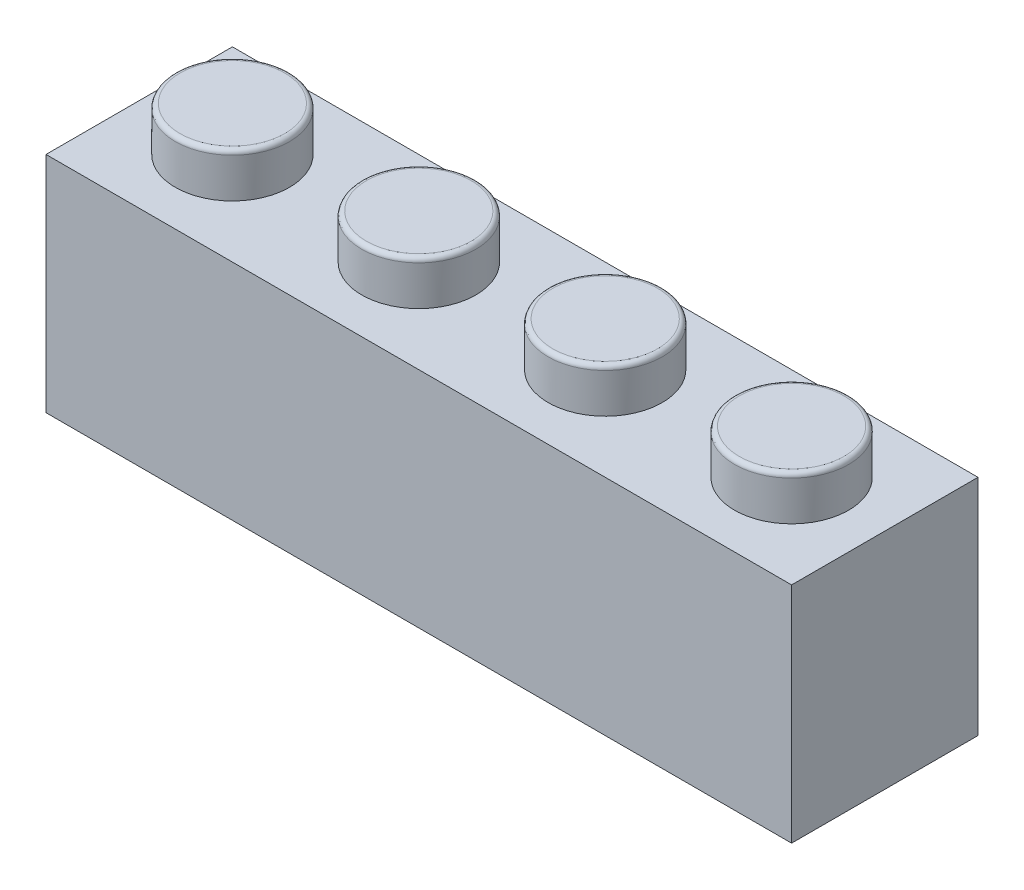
ISO-10303-21;
HEADER;
FILE_DESCRIPTION(('STEP AP214'),'2;1');
FILE_NAME('part.step','',(''),(''),'','','');
FILE_SCHEMA(('AUTOMOTIVE_DESIGN { 1 0 10303 214 1 1 1 1 }'));
ENDSEC;
DATA;
#1=APPLICATION_CONTEXT('core data for automotive mechanical design processes');
#2=APPLICATION_PROTOCOL_DEFINITION('international standard','automotive_design',2000,#1);
#3=PRODUCT_CONTEXT('',#1,'mechanical');
#4=PRODUCT('Part','Part','',(#3));
#5=PRODUCT_RELATED_PRODUCT_CATEGORY('part','',(#4));
#6=PRODUCT_DEFINITION_FORMATION('','',#4);
#7=PRODUCT_DEFINITION_CONTEXT('part definition',#1,'design');
#8=PRODUCT_DEFINITION('design','',#6,#7);
#9=PRODUCT_DEFINITION_SHAPE('','',#8);
#10=(LENGTH_UNIT() NAMED_UNIT(*) SI_UNIT(.MILLI.,.METRE.));
#11=(NAMED_UNIT(*) PLANE_ANGLE_UNIT() SI_UNIT($,.RADIAN.));
#12=(NAMED_UNIT(*) SI_UNIT($,.STERADIAN.) SOLID_ANGLE_UNIT());
#13=UNCERTAINTY_MEASURE_WITH_UNIT(LENGTH_MEASURE(1.E-05),#10,'distance_accuracy_value','');
#14=(GEOMETRIC_REPRESENTATION_CONTEXT(3) GLOBAL_UNCERTAINTY_ASSIGNED_CONTEXT((#13)) GLOBAL_UNIT_ASSIGNED_CONTEXT((#10,
#11,#12)) REPRESENTATION_CONTEXT('',''));
#15=CARTESIAN_POINT('',(0.,0.,0.));
#16=DIRECTION('',(0.,0.,1.));
#17=DIRECTION('',(1.,0.,0.));
#18=AXIS2_PLACEMENT_3D('',#15,#16,#17);
#19=CARTESIAN_POINT('',(1.6,8.5,6.4));
#20=DIRECTION('',(0.,-1.,0.));
#21=DIRECTION('',(0.,0.,-1.));
#22=AXIS2_PLACEMENT_3D('',#19,#20,#21);
#23=PLANE('',#22);
#24=CARTESIAN_POINT('',(16.,8.5,4.));
#25=DIRECTION('',(0.,-1.,0.));
#26=DIRECTION('',(0.,0.,-1.));
#27=AXIS2_PLACEMENT_3D('',#24,#25,#26);
#28=CIRCLE('',#27,1.6);
#29=CARTESIAN_POINT('',(16.,8.5,2.4));
#30=VERTEX_POINT('',#29);
#31=EDGE_CURVE('E341',#30,#30,#28,.T.);
#32=ORIENTED_EDGE('',*,*,#31,.F.);
#33=EDGE_LOOP('',(#32));
#34=FACE_BOUND('',#33,.T.);
#35=DIRECTION('',(0.,0.,-1.));
#36=VECTOR('',#35,1.);
#37=CARTESIAN_POINT('',(1.6,8.5,6.4));
#38=LINE('',#37,#36);
#39=CARTESIAN_POINT('',(1.6,8.5,6.4));
#40=VERTEX_POINT('',#39);
#41=CARTESIAN_POINT('',(1.6,8.5,1.6));
#42=VERTEX_POINT('',#41);
#43=EDGE_CURVE('E116',#40,#42,#38,.T.);
#44=ORIENTED_EDGE('',*,*,#43,.T.);
#45=DIRECTION('',(1.,0.,0.));
#46=VECTOR('',#45,1.);
#47=CARTESIAN_POINT('',(1.6,8.5,1.6));
#48=LINE('',#47,#46);
#49=CARTESIAN_POINT('',(30.4,8.5,1.6));
#50=VERTEX_POINT('',#49);
#51=EDGE_CURVE('E122',#42,#50,#48,.T.);
#52=ORIENTED_EDGE('',*,*,#51,.T.);
#53=DIRECTION('',(0.,0.,1.));
#54=VECTOR('',#53,1.);
#55=CARTESIAN_POINT('',(30.4,8.5,6.4));
#56=LINE('',#55,#54);
#57=CARTESIAN_POINT('',(30.4,8.5,6.4));
#58=VERTEX_POINT('',#57);
#59=EDGE_CURVE('E99',#50,#58,#56,.T.);
#60=ORIENTED_EDGE('',*,*,#59,.T.);
#61=DIRECTION('',(-1.,0.,0.));
#62=VECTOR('',#61,1.);
#63=CARTESIAN_POINT('',(1.6,8.5,6.4));
#64=LINE('',#63,#62);
#65=EDGE_CURVE('E125',#58,#40,#64,.T.);
#66=ORIENTED_EDGE('',*,*,#65,.T.);
#67=EDGE_LOOP('',(#44,#52,#60,#66));
#68=FACE_BOUND('',#67,.T.);
#69=CARTESIAN_POINT('',(4.,8.5,4.));
#70=DIRECTION('',(0.,-1.,0.));
#71=DIRECTION('',(0.,0.,-1.));
#72=AXIS2_PLACEMENT_3D('',#69,#70,#71);
#73=CIRCLE('',#72,1.6);
#74=CARTESIAN_POINT('',(4.,8.5,2.4));
#75=VERTEX_POINT('',#74);
#76=EDGE_CURVE('E381',#75,#75,#73,.T.);
#77=ORIENTED_EDGE('',*,*,#76,.F.);
#78=EDGE_LOOP('',(#77));
#79=FACE_BOUND('',#78,.T.);
#80=CARTESIAN_POINT('',(12.,8.5,4.));
#81=DIRECTION('',(0.,-1.,0.));
#82=DIRECTION('',(0.,0.,-1.));
#83=AXIS2_PLACEMENT_3D('',#80,#81,#82);
#84=CIRCLE('',#83,1.6);
#85=CARTESIAN_POINT('',(12.,8.5,2.4));
#86=VERTEX_POINT('',#85);
#87=EDGE_CURVE('E370',#86,#86,#84,.T.);
#88=ORIENTED_EDGE('',*,*,#87,.F.);
#89=EDGE_LOOP('',(#88));
#90=FACE_BOUND('',#89,.T.);
#91=CARTESIAN_POINT('',(20.,8.5,4.));
#92=DIRECTION('',(0.,-1.,0.));
#93=DIRECTION('',(0.,0.,-1.));
#94=AXIS2_PLACEMENT_3D('',#91,#92,#93);
#95=CIRCLE('',#94,1.6);
#96=CARTESIAN_POINT('',(20.,8.5,2.4));
#97=VERTEX_POINT('',#96);
#98=EDGE_CURVE('E364',#97,#97,#95,.T.);
#99=ORIENTED_EDGE('',*,*,#98,.F.);
#100=EDGE_LOOP('',(#99));
#101=FACE_BOUND('',#100,.T.);
#102=CARTESIAN_POINT('',(28.,8.5,4.));
#103=DIRECTION('',(0.,-1.,0.));
#104=DIRECTION('',(0.,0.,-1.));
#105=AXIS2_PLACEMENT_3D('',#102,#103,#104);
#106=CIRCLE('',#105,1.6);
#107=CARTESIAN_POINT('',(28.,8.5,2.4));
#108=VERTEX_POINT('',#107);
#109=EDGE_CURVE('E358',#108,#108,#106,.T.);
#110=ORIENTED_EDGE('',*,*,#109,.F.);
#111=EDGE_LOOP('',(#110));
#112=FACE_BOUND('',#111,.T.);
#113=CARTESIAN_POINT('',(8.,8.5,4.));
#114=DIRECTION('',(0.,-1.,0.));
#115=DIRECTION('',(0.,0.,-1.));
#116=AXIS2_PLACEMENT_3D('',#113,#114,#115);
#117=CIRCLE('',#116,1.6);
#118=CARTESIAN_POINT('',(8.,8.5,2.4));
#119=VERTEX_POINT('',#118);
#120=EDGE_CURVE('E352',#119,#119,#117,.T.);
#121=ORIENTED_EDGE('',*,*,#120,.F.);
#122=EDGE_LOOP('',(#121));
#123=FACE_BOUND('',#122,.T.);
#124=CARTESIAN_POINT('',(24.,8.5,4.));
#125=DIRECTION('',(0.,-1.,0.));
#126=DIRECTION('',(0.,0.,-1.));
#127=AXIS2_PLACEMENT_3D('',#124,#125,#126);
#128=CIRCLE('',#127,1.6);
#129=CARTESIAN_POINT('',(24.,8.5,2.4));
#130=VERTEX_POINT('',#129);
#131=EDGE_CURVE('E342',#130,#130,#128,.T.);
#132=ORIENTED_EDGE('',*,*,#131,.F.);
#133=EDGE_LOOP('',(#132));
#134=FACE_BOUND('',#133,.T.);
#135=ADVANCED_FACE('F26',(#34,#68,#79,#90,#101,#112,#123,#134),#23,.T.);
#136=CARTESIAN_POINT('',(0.,9.6,8.));
#137=DIRECTION('',(0.,-1.,0.));
#138=DIRECTION('',(0.,0.,-1.));
#139=AXIS2_PLACEMENT_3D('',#136,#137,#138);
#140=PLANE('',#139);
#141=CARTESIAN_POINT('',(4.,9.6,4.));
#142=DIRECTION('',(0.,-1.,0.));
#143=DIRECTION('',(0.,0.,-1.));
#144=AXIS2_PLACEMENT_3D('',#141,#142,#143);
#145=CIRCLE('',#144,2.45);
#146=CARTESIAN_POINT('',(4.,9.6,1.55));
#147=VERTEX_POINT('',#146);
#148=EDGE_CURVE('E160',#147,#147,#145,.F.);
#149=ORIENTED_EDGE('',*,*,#148,.F.);
#150=EDGE_LOOP('',(#149));
#151=FACE_BOUND('',#150,.T.);
#152=DIRECTION('',(-1.,0.,0.));
#153=VECTOR('',#152,1.);
#154=CARTESIAN_POINT('',(0.,9.6,0.));
#155=LINE('',#154,#153);
#156=CARTESIAN_POINT('',(32.,9.6,0.));
#157=VERTEX_POINT('',#156);
#158=CARTESIAN_POINT('',(0.,9.6,0.));
#159=VERTEX_POINT('',#158);
#160=EDGE_CURVE('E139',#157,#159,#155,.T.);
#161=ORIENTED_EDGE('',*,*,#160,.T.);
#162=DIRECTION('',(0.,0.,-1.));
#163=VECTOR('',#162,1.);
#164=CARTESIAN_POINT('',(0.,9.6,8.));
#165=LINE('',#164,#163);
#166=CARTESIAN_POINT('',(0.,9.6,8.));
#167=VERTEX_POINT('',#166);
#168=EDGE_CURVE('E148',#167,#159,#165,.T.);
#169=ORIENTED_EDGE('',*,*,#168,.F.);
#170=DIRECTION('',(-1.,0.,0.));
#171=VECTOR('',#170,1.);
#172=CARTESIAN_POINT('',(0.,9.6,8.));
#173=LINE('',#172,#171);
#174=CARTESIAN_POINT('',(32.,9.6,8.));
#175=VERTEX_POINT('',#174);
#176=EDGE_CURVE('E49',#175,#167,#173,.T.);
#177=ORIENTED_EDGE('',*,*,#176,.F.);
#178=DIRECTION('',(0.,0.,-1.));
#179=VECTOR('',#178,1.);
#180=CARTESIAN_POINT('',(32.,9.6,8.));
#181=LINE('',#180,#179);
#182=EDGE_CURVE('E151',#175,#157,#181,.T.);
#183=ORIENTED_EDGE('',*,*,#182,.T.);
#184=EDGE_LOOP('',(#161,#169,#177,#183));
#185=FACE_BOUND('',#184,.T.);
#186=CARTESIAN_POINT('',(12.,9.6,4.));
#187=DIRECTION('',(0.,-1.,0.));
#188=DIRECTION('',(0.,0.,-1.));
#189=AXIS2_PLACEMENT_3D('',#186,#187,#188);
#190=CIRCLE('',#189,2.45);
#191=CARTESIAN_POINT('',(12.,9.6,1.55));
#192=VERTEX_POINT('',#191);
#193=EDGE_CURVE('E169',#192,#192,#190,.F.);
#194=ORIENTED_EDGE('',*,*,#193,.F.);
#195=EDGE_LOOP('',(#194));
#196=FACE_BOUND('',#195,.T.);
#197=CARTESIAN_POINT('',(20.,9.6,4.));
#198=DIRECTION('',(0.,-1.,0.));
#199=DIRECTION('',(0.,0.,-1.));
#200=AXIS2_PLACEMENT_3D('',#197,#198,#199);
#201=CIRCLE('',#200,2.45);
#202=CARTESIAN_POINT('',(20.,9.6,1.55));
#203=VERTEX_POINT('',#202);
#204=EDGE_CURVE('E172',#203,#203,#201,.F.);
#205=ORIENTED_EDGE('',*,*,#204,.F.);
#206=EDGE_LOOP('',(#205));
#207=FACE_BOUND('',#206,.T.);
#208=CARTESIAN_POINT('',(28.,9.6,4.));
#209=DIRECTION('',(0.,-1.,0.));
#210=DIRECTION('',(0.,0.,-1.));
#211=AXIS2_PLACEMENT_3D('',#208,#209,#210);
#212=CIRCLE('',#211,2.45);
#213=CARTESIAN_POINT('',(28.,9.6,1.55));
#214=VERTEX_POINT('',#213);
#215=EDGE_CURVE('E181',#214,#214,#212,.F.);
#216=ORIENTED_EDGE('',*,*,#215,.F.);
#217=EDGE_LOOP('',(#216));
#218=FACE_BOUND('',#217,.T.);
#219=ADVANCED_FACE('F202',(#151,#185,#196,#207,#218),#140,.F.);
#220=CARTESIAN_POINT('',(0.,0.,8.));
#221=DIRECTION('',(1.,0.,0.));
#222=DIRECTION('',(0.,0.,-1.));
#223=AXIS2_PLACEMENT_3D('',#220,#221,#222);
#224=PLANE('',#223);
#225=DIRECTION('',(0.,-1.,0.));
#226=VECTOR('',#225,1.);
#227=CARTESIAN_POINT('',(0.,0.,0.));
#228=LINE('',#227,#226);
#229=CARTESIAN_POINT('',(0.,0.,0.));
#230=VERTEX_POINT('',#229);
#231=EDGE_CURVE('E130',#159,#230,#228,.T.);
#232=ORIENTED_EDGE('',*,*,#231,.T.);
#233=DIRECTION('',(0.,0.,-1.));
#234=VECTOR('',#233,1.);
#235=CARTESIAN_POINT('',(0.,0.,8.));
#236=LINE('',#235,#234);
#237=CARTESIAN_POINT('',(0.,0.,8.));
#238=VERTEX_POINT('',#237);
#239=EDGE_CURVE('E157',#238,#230,#236,.T.);
#240=ORIENTED_EDGE('',*,*,#239,.F.);
#241=DIRECTION('',(0.,-1.,0.));
#242=VECTOR('',#241,1.);
#243=CARTESIAN_POINT('',(0.,0.,8.));
#244=LINE('',#243,#242);
#245=EDGE_CURVE('E141',#167,#238,#244,.T.);
#246=ORIENTED_EDGE('',*,*,#245,.F.);
#247=ORIENTED_EDGE('',*,*,#168,.T.);
#248=EDGE_LOOP('',(#232,#240,#246,#247));
#249=FACE_BOUND('',#248,.T.);
#250=ADVANCED_FACE('F210',(#249),#224,.F.);
#251=CARTESIAN_POINT('',(0.,0.,8.));
#252=DIRECTION('',(0.,1.,0.));
#253=DIRECTION('',(0.,0.,1.));
#254=AXIS2_PLACEMENT_3D('',#251,#252,#253);
#255=PLANE('',#254);
#256=DIRECTION('',(1.,0.,0.));
#257=VECTOR('',#256,1.);
#258=CARTESIAN_POINT('',(1.6,0.,1.6));
#259=LINE('',#258,#257);
#260=CARTESIAN_POINT('',(1.6,0.,1.6));
#261=VERTEX_POINT('',#260);
#262=CARTESIAN_POINT('',(30.4,0.,1.6));
#263=VERTEX_POINT('',#262);
#264=EDGE_CURVE('E107',#261,#263,#259,.T.);
#265=ORIENTED_EDGE('',*,*,#264,.F.);
#266=DIRECTION('',(0.,0.,-1.));
#267=VECTOR('',#266,1.);
#268=CARTESIAN_POINT('',(1.6,0.,6.4));
#269=LINE('',#268,#267);
#270=CARTESIAN_POINT('',(1.6,0.,6.4));
#271=VERTEX_POINT('',#270);
#272=EDGE_CURVE('E41',#271,#261,#269,.T.);
#273=ORIENTED_EDGE('',*,*,#272,.F.);
#274=DIRECTION('',(-1.,0.,0.));
#275=VECTOR('',#274,1.);
#276=CARTESIAN_POINT('',(1.6,0.,6.4));
#277=LINE('',#276,#275);
#278=CARTESIAN_POINT('',(30.4,0.,6.4));
#279=VERTEX_POINT('',#278);
#280=EDGE_CURVE('E114',#279,#271,#277,.T.);
#281=ORIENTED_EDGE('',*,*,#280,.F.);
#282=DIRECTION('',(0.,0.,1.));
#283=VECTOR('',#282,1.);
#284=CARTESIAN_POINT('',(30.4,0.,6.4));
#285=LINE('',#284,#283);
#286=EDGE_CURVE('E96',#263,#279,#285,.T.);
#287=ORIENTED_EDGE('',*,*,#286,.F.);
#288=EDGE_LOOP('',(#265,#273,#281,#287));
#289=FACE_BOUND('',#288,.T.);
#290=DIRECTION('',(1.,0.,0.));
#291=VECTOR('',#290,1.);
#292=CARTESIAN_POINT('',(0.,0.,0.));
#293=LINE('',#292,#291);
#294=CARTESIAN_POINT('',(32.,0.,0.));
#295=VERTEX_POINT('',#294);
#296=EDGE_CURVE('E135',#230,#295,#293,.T.);
#297=ORIENTED_EDGE('',*,*,#296,.T.);
#298=DIRECTION('',(0.,0.,-1.));
#299=VECTOR('',#298,1.);
#300=CARTESIAN_POINT('',(32.,0.,8.));
#301=LINE('',#300,#299);
#302=CARTESIAN_POINT('',(32.,0.,8.));
#303=VERTEX_POINT('',#302);
#304=EDGE_CURVE('E154',#303,#295,#301,.T.);
#305=ORIENTED_EDGE('',*,*,#304,.F.);
#306=DIRECTION('',(1.,0.,0.));
#307=VECTOR('',#306,1.);
#308=CARTESIAN_POINT('',(0.,0.,8.));
#309=LINE('',#308,#307);
#310=EDGE_CURVE('E143',#238,#303,#309,.T.);
#311=ORIENTED_EDGE('',*,*,#310,.F.);
#312=ORIENTED_EDGE('',*,*,#239,.T.);
#313=EDGE_LOOP('',(#297,#305,#311,#312));
#314=FACE_BOUND('',#313,.T.);
#315=ADVANCED_FACE('F111',(#289,#314),#255,.F.);
#316=CARTESIAN_POINT('',(32.,0.,8.));
#317=DIRECTION('',(-1.,0.,0.));
#318=DIRECTION('',(0.,0.,1.));
#319=AXIS2_PLACEMENT_3D('',#316,#317,#318);
#320=PLANE('',#319);
#321=DIRECTION('',(0.,1.,0.));
#322=VECTOR('',#321,1.);
#323=CARTESIAN_POINT('',(32.,0.,0.));
#324=LINE('',#323,#322);
#325=EDGE_CURVE('E137',#295,#157,#324,.T.);
#326=ORIENTED_EDGE('',*,*,#325,.T.);
#327=ORIENTED_EDGE('',*,*,#182,.F.);
#328=DIRECTION('',(0.,1.,0.));
#329=VECTOR('',#328,1.);
#330=CARTESIAN_POINT('',(32.,0.,8.));
#331=LINE('',#330,#329);
#332=EDGE_CURVE('E145',#303,#175,#331,.T.);
#333=ORIENTED_EDGE('',*,*,#332,.F.);
#334=ORIENTED_EDGE('',*,*,#304,.T.);
#335=EDGE_LOOP('',(#326,#327,#333,#334));
#336=FACE_BOUND('',#335,.T.);
#337=ADVANCED_FACE('F248',(#336),#320,.F.);
#338=CARTESIAN_POINT('',(0.,9.6,8.));
#339=DIRECTION('',(0.,0.,-1.));
#340=DIRECTION('',(-1.,0.,0.));
#341=AXIS2_PLACEMENT_3D('',#338,#339,#340);
#342=PLANE('',#341);
#343=ORIENTED_EDGE('',*,*,#245,.T.);
#344=ORIENTED_EDGE('',*,*,#310,.T.);
#345=ORIENTED_EDGE('',*,*,#332,.T.);
#346=ORIENTED_EDGE('',*,*,#176,.T.);
#347=EDGE_LOOP('',(#343,#344,#345,#346));
#348=FACE_BOUND('',#347,.T.);
#349=ADVANCED_FACE('F245',(#348),#342,.F.);
#350=CARTESIAN_POINT('',(0.,9.6,0.));
#351=DIRECTION('',(0.,0.,-1.));
#352=DIRECTION('',(-1.,0.,0.));
#353=AXIS2_PLACEMENT_3D('',#350,#351,#352);
#354=PLANE('',#353);
#355=ORIENTED_EDGE('',*,*,#231,.F.);
#356=ORIENTED_EDGE('',*,*,#160,.F.);
#357=ORIENTED_EDGE('',*,*,#325,.F.);
#358=ORIENTED_EDGE('',*,*,#296,.F.);
#359=EDGE_LOOP('',(#355,#356,#357,#358));
#360=FACE_BOUND('',#359,.T.);
#361=ADVANCED_FACE('F241',(#360),#354,.T.);
#362=CARTESIAN_POINT('',(4.,11.5,4.));
#363=DIRECTION('',(0.,-1.,0.));
#364=DIRECTION('',(0.,0.,-1.));
#365=AXIS2_PLACEMENT_3D('',#362,#363,#364);
#366=CYLINDRICAL_SURFACE('',#365,2.45);
#367=CARTESIAN_POINT('',(4.,11.3,4.));
#368=DIRECTION('',(0.,1.,0.));
#369=DIRECTION('',(0.,0.,1.));
#370=AXIS2_PLACEMENT_3D('',#367,#368,#369);
#371=CIRCLE('',#370,2.45);
#372=CARTESIAN_POINT('',(4.,11.3,1.55));
#373=VERTEX_POINT('',#372);
#374=EDGE_CURVE('E166',#373,#373,#371,.F.);
#375=CARTESIAN_POINT('',(4.,11.3,1.55));
#376=CARTESIAN_POINT('',(4.,11.2822916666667,1.55));
#377=CARTESIAN_POINT('',(4.,11.2645833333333,1.55));
#378=CARTESIAN_POINT('',(4.,11.2291666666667,1.55));
#379=CARTESIAN_POINT('',(4.,11.2114583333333,1.55));
#380=CARTESIAN_POINT('',(4.,11.1760416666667,1.55));
#381=CARTESIAN_POINT('',(4.,11.1583333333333,1.55));
#382=CARTESIAN_POINT('',(4.,11.1229166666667,1.55));
#383=CARTESIAN_POINT('',(4.,11.1052083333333,1.55));
#384=CARTESIAN_POINT('',(4.,11.0697916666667,1.55));
#385=CARTESIAN_POINT('',(4.,11.0520833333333,1.55));
#386=CARTESIAN_POINT('',(4.,11.0166666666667,1.55));
#387=CARTESIAN_POINT('',(4.,10.9989583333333,1.55));
#388=CARTESIAN_POINT('',(4.,10.9635416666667,1.55));
#389=CARTESIAN_POINT('',(4.,10.9458333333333,1.55));
#390=CARTESIAN_POINT('',(4.,10.9104166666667,1.55));
#391=CARTESIAN_POINT('',(4.,10.8927083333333,1.55));
#392=CARTESIAN_POINT('',(4.,10.8572916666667,1.55));
#393=CARTESIAN_POINT('',(4.,10.8395833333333,1.55));
#394=CARTESIAN_POINT('',(4.,10.8041666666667,1.55));
#395=CARTESIAN_POINT('',(4.,10.7864583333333,1.55));
#396=CARTESIAN_POINT('',(4.,10.7510416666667,1.55));
#397=CARTESIAN_POINT('',(4.,10.7333333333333,1.55));
#398=CARTESIAN_POINT('',(4.,10.6979166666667,1.55));
#399=CARTESIAN_POINT('',(4.,10.6802083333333,1.55));
#400=CARTESIAN_POINT('',(4.,10.6447916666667,1.55));
#401=CARTESIAN_POINT('',(4.,10.6270833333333,1.55));
#402=CARTESIAN_POINT('',(4.,10.5916666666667,1.55));
#403=CARTESIAN_POINT('',(4.,10.5739583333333,1.55));
#404=CARTESIAN_POINT('',(4.,10.5385416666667,1.55));
#405=CARTESIAN_POINT('',(4.,10.5208333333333,1.55));
#406=CARTESIAN_POINT('',(4.,10.4854166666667,1.55));
#407=CARTESIAN_POINT('',(4.,10.4677083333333,1.55));
#408=CARTESIAN_POINT('',(4.,10.4322916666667,1.55));
#409=CARTESIAN_POINT('',(4.,10.4145833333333,1.55));
#410=CARTESIAN_POINT('',(4.,10.3791666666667,1.55));
#411=CARTESIAN_POINT('',(4.,10.3614583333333,1.55));
#412=CARTESIAN_POINT('',(4.,10.3260416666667,1.55));
#413=CARTESIAN_POINT('',(4.,10.3083333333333,1.55));
#414=CARTESIAN_POINT('',(4.,10.2729166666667,1.55));
#415=CARTESIAN_POINT('',(4.,10.2552083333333,1.55));
#416=CARTESIAN_POINT('',(4.,10.2197916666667,1.55));
#417=CARTESIAN_POINT('',(4.,10.2020833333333,1.55));
#418=CARTESIAN_POINT('',(4.,10.1666666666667,1.55));
#419=CARTESIAN_POINT('',(4.,10.1489583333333,1.55));
#420=CARTESIAN_POINT('',(4.,10.1135416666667,1.55));
#421=CARTESIAN_POINT('',(4.,10.0958333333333,1.55));
#422=CARTESIAN_POINT('',(4.,10.0604166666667,1.55));
#423=CARTESIAN_POINT('',(4.,10.0427083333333,1.55));
#424=CARTESIAN_POINT('',(4.,10.0072916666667,1.55));
#425=CARTESIAN_POINT('',(4.,9.98958333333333,1.55));
#426=CARTESIAN_POINT('',(4.,9.95416666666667,1.55));
#427=CARTESIAN_POINT('',(4.,9.93645833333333,1.55));
#428=CARTESIAN_POINT('',(4.,9.90104166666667,1.55));
#429=CARTESIAN_POINT('',(4.,9.88333333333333,1.55));
#430=CARTESIAN_POINT('',(4.,9.84791666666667,1.55));
#431=CARTESIAN_POINT('',(4.,9.83020833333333,1.55));
#432=CARTESIAN_POINT('',(4.,9.79479166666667,1.55));
#433=CARTESIAN_POINT('',(4.,9.77708333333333,1.55));
#434=CARTESIAN_POINT('',(4.,9.74166666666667,1.55));
#435=CARTESIAN_POINT('',(4.,9.72395833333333,1.55));
#436=CARTESIAN_POINT('',(4.,9.68854166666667,1.55));
#437=CARTESIAN_POINT('',(4.,9.67083333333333,1.55));
#438=CARTESIAN_POINT('',(4.,9.63541666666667,1.55));
#439=CARTESIAN_POINT('',(4.,9.61770833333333,1.55));
#440=CARTESIAN_POINT('',(4.,9.6,1.55));
#441=B_SPLINE_CURVE_WITH_KNOTS('',3,(#375,#376,#377,#378,#379,#380,#381,#382,#383,#384,#385,
#386,#387,#388,#389,#390,#391,#392,#393,#394,#395,#396,#397,#398,#399,#400,#401,#402,#403,#404,
#405,#406,#407,#408,#409,#410,#411,#412,#413,#414,#415,#416,#417,#418,#419,#420,#421,#422,#423,
#424,#425,#426,#427,#428,#429,#430,#431,#432,#433,#434,#435,#436,#437,#438,#439,#440),
.UNSPECIFIED.,.F.,.F.,(4,2,2,2,2,2,2,2,2,2,2,2,2,2,2,2,2,2,2,2,2,2,2,2,2,2,2,2,2,2,2,2,4),(0.,
0.0531250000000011,0.10625,0.159375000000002,0.212500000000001,0.265625,0.318750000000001,
0.371875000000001,0.425,0.478125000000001,0.53125,0.584375,0.637500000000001,0.690625,0.74375,
0.796875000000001,0.85,0.903124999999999,0.95625,1.009375,1.0625,1.115625,1.16875,1.221875,
1.275,1.328125,1.38125,1.434375,1.4875,1.540625,1.59375,1.646875,1.7),.UNSPECIFIED.);
#442=EDGE_CURVE('BSEAM237',#373,#147,#441,.T.);
#443=ORIENTED_EDGE('',*,*,#374,.T.);
#444=ORIENTED_EDGE('',*,*,#148,.T.);
#445=ORIENTED_EDGE('',*,*,#442,.T.);
#446=ORIENTED_EDGE('',*,*,#442,.F.);
#447=EDGE_LOOP('',(#443,#445,#444,#446));
#448=FACE_BOUND('',#447,.T.);
#449=ADVANCED_FACE('F237',(#448),#366,.T.);
#450=CARTESIAN_POINT('',(4.,11.5,4.));
#451=DIRECTION('',(0.,1.,0.));
#452=DIRECTION('',(0.,0.,1.));
#453=AXIS2_PLACEMENT_3D('',#450,#451,#452);
#454=PLANE('',#453);
#455=CARTESIAN_POINT('',(4.,11.5,4.));
#456=DIRECTION('',(0.,1.,0.));
#457=DIRECTION('',(0.,0.,1.));
#458=AXIS2_PLACEMENT_3D('',#455,#456,#457);
#459=CIRCLE('',#458,2.25);
#460=CARTESIAN_POINT('',(4.,11.5,6.25));
#461=VERTEX_POINT('',#460);
#462=EDGE_CURVE('E163',#461,#461,#459,.T.);
#463=ORIENTED_EDGE('',*,*,#462,.T.);
#464=EDGE_LOOP('',(#463));
#465=FACE_BOUND('',#464,.T.);
#466=ADVANCED_FACE('F233',(#465),#454,.T.);
#467=CARTESIAN_POINT('',(4.,11.3,4.));
#468=DIRECTION('',(0.,1.,0.));
#469=DIRECTION('',(0.,0.,1.));
#470=AXIS2_PLACEMENT_3D('',#467,#468,#469);
#471=TOROIDAL_SURFACE('',#470,2.25,0.2);
#472=ORIENTED_EDGE('',*,*,#374,.F.);
#473=EDGE_LOOP('',(#472));
#474=FACE_BOUND('',#473,.T.);
#475=ORIENTED_EDGE('',*,*,#462,.F.);
#476=EDGE_LOOP('',(#475));
#477=FACE_BOUND('',#476,.T.);
#478=ADVANCED_FACE('F230',(#474,#477),#471,.T.);
#479=CARTESIAN_POINT('',(1.6,8.5,6.4));
#480=DIRECTION('',(-1.,0.,0.));
#481=DIRECTION('',(0.,0.,1.));
#482=AXIS2_PLACEMENT_3D('',#479,#480,#481);
#483=PLANE('',#482);
#484=ORIENTED_EDGE('',*,*,#272,.T.);
#485=DIRECTION('',(0.,-1.,0.));
#486=VECTOR('',#485,1.);
#487=CARTESIAN_POINT('',(1.6,8.5,1.6));
#488=LINE('',#487,#486);
#489=EDGE_CURVE('E104',#42,#261,#488,.T.);
#490=ORIENTED_EDGE('',*,*,#489,.F.);
#491=ORIENTED_EDGE('',*,*,#43,.F.);
#492=DIRECTION('',(0.,-1.,0.));
#493=VECTOR('',#492,1.);
#494=CARTESIAN_POINT('',(1.6,8.5,6.4));
#495=LINE('',#494,#493);
#496=EDGE_CURVE('E128',#40,#271,#495,.T.);
#497=ORIENTED_EDGE('',*,*,#496,.T.);
#498=EDGE_LOOP('',(#484,#490,#491,#497));
#499=FACE_BOUND('',#498,.T.);
#500=ADVANCED_FACE('F222',(#499),#483,.F.);
#501=CARTESIAN_POINT('',(1.6,8.5,6.4));
#502=DIRECTION('',(0.,0.,1.));
#503=DIRECTION('',(1.,0.,0.));
#504=AXIS2_PLACEMENT_3D('',#501,#502,#503);
#505=PLANE('',#504);
#506=ORIENTED_EDGE('',*,*,#280,.T.);
#507=ORIENTED_EDGE('',*,*,#496,.F.);
#508=ORIENTED_EDGE('',*,*,#65,.F.);
#509=DIRECTION('',(0.,-1.,0.));
#510=VECTOR('',#509,1.);
#511=CARTESIAN_POINT('',(30.4,8.5,6.4));
#512=LINE('',#511,#510);
#513=EDGE_CURVE('E103',#58,#279,#512,.T.);
#514=ORIENTED_EDGE('',*,*,#513,.T.);
#515=EDGE_LOOP('',(#506,#507,#508,#514));
#516=FACE_BOUND('',#515,.T.);
#517=ADVANCED_FACE('F219',(#516),#505,.F.);
#518=CARTESIAN_POINT('',(30.4,8.5,6.4));
#519=DIRECTION('',(1.,0.,0.));
#520=DIRECTION('',(0.,0.,-1.));
#521=AXIS2_PLACEMENT_3D('',#518,#519,#520);
#522=PLANE('',#521);
#523=ORIENTED_EDGE('',*,*,#286,.T.);
#524=ORIENTED_EDGE('',*,*,#513,.F.);
#525=ORIENTED_EDGE('',*,*,#59,.F.);
#526=DIRECTION('',(0.,-1.,0.));
#527=VECTOR('',#526,1.);
#528=CARTESIAN_POINT('',(30.4,8.5,1.6));
#529=LINE('',#528,#527);
#530=EDGE_CURVE('E92',#50,#263,#529,.T.);
#531=ORIENTED_EDGE('',*,*,#530,.T.);
#532=EDGE_LOOP('',(#523,#524,#525,#531));
#533=FACE_BOUND('',#532,.T.);
#534=ADVANCED_FACE('F94',(#533),#522,.F.);
#535=CARTESIAN_POINT('',(1.6,8.5,1.6));
#536=DIRECTION('',(0.,0.,-1.));
#537=DIRECTION('',(-1.,0.,0.));
#538=AXIS2_PLACEMENT_3D('',#535,#536,#537);
#539=PLANE('',#538);
#540=ORIENTED_EDGE('',*,*,#264,.T.);
#541=ORIENTED_EDGE('',*,*,#530,.F.);
#542=ORIENTED_EDGE('',*,*,#51,.F.);
#543=ORIENTED_EDGE('',*,*,#489,.T.);
#544=EDGE_LOOP('',(#540,#541,#542,#543));
#545=FACE_BOUND('',#544,.T.);
#546=ADVANCED_FACE('F108',(#545),#539,.F.);
#547=CARTESIAN_POINT('',(4.,10.3,4.));
#548=DIRECTION('',(0.,-1.,0.));
#549=DIRECTION('',(0.,0.,-1.));
#550=AXIS2_PLACEMENT_3D('',#547,#548,#549);
#551=CYLINDRICAL_SURFACE('',#550,1.6);
#552=CARTESIAN_POINT('',(4.,10.3,4.));
#553=DIRECTION('',(0.,-1.,0.));
#554=DIRECTION('',(0.,0.,-1.));
#555=AXIS2_PLACEMENT_3D('',#552,#553,#554);
#556=CIRCLE('',#555,1.6);
#557=CARTESIAN_POINT('',(4.,10.3,2.4));
#558=VERTEX_POINT('',#557);
#559=EDGE_CURVE('E384',#558,#558,#556,.T.);
#560=ORIENTED_EDGE('',*,*,#559,.F.);
#561=EDGE_LOOP('',(#560));
#562=FACE_BOUND('',#561,.T.);
#563=ORIENTED_EDGE('',*,*,#76,.T.);
#564=EDGE_LOOP('',(#563));
#565=FACE_BOUND('',#564,.T.);
#566=ADVANCED_FACE('F217',(#562,#565),#551,.F.);
#567=CARTESIAN_POINT('',(4.,10.3,4.));
#568=DIRECTION('',(0.,-1.,0.));
#569=DIRECTION('',(0.,0.,-1.));
#570=AXIS2_PLACEMENT_3D('',#567,#568,#569);
#571=PLANE('',#570);
#572=ORIENTED_EDGE('',*,*,#559,.T.);
#573=EDGE_LOOP('',(#572));
#574=FACE_BOUND('',#573,.T.);
#575=ADVANCED_FACE('F276',(#574),#571,.T.);
#576=CARTESIAN_POINT('',(12.,11.5,4.));
#577=DIRECTION('',(0.,-1.,0.));
#578=DIRECTION('',(0.,0.,-1.));
#579=AXIS2_PLACEMENT_3D('',#576,#577,#578);
#580=CYLINDRICAL_SURFACE('',#579,2.45);
#581=CARTESIAN_POINT('',(12.,11.3,4.));
#582=DIRECTION('',(0.,1.,0.));
#583=DIRECTION('',(0.,0.,1.));
#584=AXIS2_PLACEMENT_3D('',#581,#582,#583);
#585=CIRCLE('',#584,2.45);
#586=CARTESIAN_POINT('',(12.,11.3,1.55));
#587=VERTEX_POINT('',#586);
#588=EDGE_CURVE('E376',#587,#587,#585,.F.);
#589=CARTESIAN_POINT('',(12.,11.3,1.55));
#590=CARTESIAN_POINT('',(12.,11.2822916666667,1.55));
#591=CARTESIAN_POINT('',(12.,11.2645833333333,1.55));
#592=CARTESIAN_POINT('',(12.,11.2291666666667,1.55));
#593=CARTESIAN_POINT('',(12.,11.2114583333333,1.55));
#594=CARTESIAN_POINT('',(12.,11.1760416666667,1.55));
#595=CARTESIAN_POINT('',(12.,11.1583333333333,1.55));
#596=CARTESIAN_POINT('',(12.,11.1229166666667,1.55));
#597=CARTESIAN_POINT('',(12.,11.1052083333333,1.55));
#598=CARTESIAN_POINT('',(12.,11.0697916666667,1.55));
#599=CARTESIAN_POINT('',(12.,11.0520833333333,1.55));
#600=CARTESIAN_POINT('',(12.,11.0166666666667,1.55));
#601=CARTESIAN_POINT('',(12.,10.9989583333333,1.55));
#602=CARTESIAN_POINT('',(12.,10.9635416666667,1.55));
#603=CARTESIAN_POINT('',(12.,10.9458333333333,1.55));
#604=CARTESIAN_POINT('',(12.,10.9104166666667,1.55));
#605=CARTESIAN_POINT('',(12.,10.8927083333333,1.55));
#606=CARTESIAN_POINT('',(12.,10.8572916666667,1.55));
#607=CARTESIAN_POINT('',(12.,10.8395833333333,1.55));
#608=CARTESIAN_POINT('',(12.,10.8041666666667,1.55));
#609=CARTESIAN_POINT('',(12.,10.7864583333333,1.55));
#610=CARTESIAN_POINT('',(12.,10.7510416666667,1.55));
#611=CARTESIAN_POINT('',(12.,10.7333333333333,1.55));
#612=CARTESIAN_POINT('',(12.,10.6979166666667,1.55));
#613=CARTESIAN_POINT('',(12.,10.6802083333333,1.55));
#614=CARTESIAN_POINT('',(12.,10.6447916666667,1.55));
#615=CARTESIAN_POINT('',(12.,10.6270833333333,1.55));
#616=CARTESIAN_POINT('',(12.,10.5916666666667,1.55));
#617=CARTESIAN_POINT('',(12.,10.5739583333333,1.55));
#618=CARTESIAN_POINT('',(12.,10.5385416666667,1.55));
#619=CARTESIAN_POINT('',(12.,10.5208333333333,1.55));
#620=CARTESIAN_POINT('',(12.,10.4854166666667,1.55));
#621=CARTESIAN_POINT('',(12.,10.4677083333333,1.55));
#622=CARTESIAN_POINT('',(12.,10.4322916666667,1.55));
#623=CARTESIAN_POINT('',(12.,10.4145833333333,1.55));
#624=CARTESIAN_POINT('',(12.,10.3791666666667,1.55));
#625=CARTESIAN_POINT('',(12.,10.3614583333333,1.55));
#626=CARTESIAN_POINT('',(12.,10.3260416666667,1.55));
#627=CARTESIAN_POINT('',(12.,10.3083333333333,1.55));
#628=CARTESIAN_POINT('',(12.,10.2729166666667,1.55));
#629=CARTESIAN_POINT('',(12.,10.2552083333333,1.55));
#630=CARTESIAN_POINT('',(12.,10.2197916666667,1.55));
#631=CARTESIAN_POINT('',(12.,10.2020833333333,1.55));
#632=CARTESIAN_POINT('',(12.,10.1666666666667,1.55));
#633=CARTESIAN_POINT('',(12.,10.1489583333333,1.55));
#634=CARTESIAN_POINT('',(12.,10.1135416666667,1.55));
#635=CARTESIAN_POINT('',(12.,10.0958333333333,1.55));
#636=CARTESIAN_POINT('',(12.,10.0604166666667,1.55));
#637=CARTESIAN_POINT('',(12.,10.0427083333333,1.55));
#638=CARTESIAN_POINT('',(12.,10.0072916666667,1.55));
#639=CARTESIAN_POINT('',(12.,9.98958333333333,1.55));
#640=CARTESIAN_POINT('',(12.,9.95416666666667,1.55));
#641=CARTESIAN_POINT('',(12.,9.93645833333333,1.55));
#642=CARTESIAN_POINT('',(12.,9.90104166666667,1.55));
#643=CARTESIAN_POINT('',(12.,9.88333333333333,1.55));
#644=CARTESIAN_POINT('',(12.,9.84791666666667,1.55));
#645=CARTESIAN_POINT('',(12.,9.83020833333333,1.55));
#646=CARTESIAN_POINT('',(12.,9.79479166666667,1.55));
#647=CARTESIAN_POINT('',(12.,9.77708333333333,1.55));
#648=CARTESIAN_POINT('',(12.,9.74166666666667,1.55));
#649=CARTESIAN_POINT('',(12.,9.72395833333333,1.55));
#650=CARTESIAN_POINT('',(12.,9.68854166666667,1.55));
#651=CARTESIAN_POINT('',(12.,9.67083333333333,1.55));
#652=CARTESIAN_POINT('',(12.,9.63541666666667,1.55));
#653=CARTESIAN_POINT('',(12.,9.61770833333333,1.55));
#654=CARTESIAN_POINT('',(12.,9.6,1.55));
#655=B_SPLINE_CURVE_WITH_KNOTS('',3,(#589,#590,#591,#592,#593,#594,#595,#596,#597,#598,#599,
#600,#601,#602,#603,#604,#605,#606,#607,#608,#609,#610,#611,#612,#613,#614,#615,#616,#617,#618,
#619,#620,#621,#622,#623,#624,#625,#626,#627,#628,#629,#630,#631,#632,#633,#634,#635,#636,#637,
#638,#639,#640,#641,#642,#643,#644,#645,#646,#647,#648,#649,#650,#651,#652,#653,#654),
.UNSPECIFIED.,.F.,.F.,(4,2,2,2,2,2,2,2,2,2,2,2,2,2,2,2,2,2,2,2,2,2,2,2,2,2,2,2,2,2,2,2,4),(0.,
0.0531250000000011,0.10625,0.159375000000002,0.212500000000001,0.265625,0.318750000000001,
0.371875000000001,0.425,0.478125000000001,0.53125,0.584375,0.637500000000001,0.690625,0.74375,
0.796875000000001,0.85,0.903124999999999,0.95625,1.009375,1.0625,1.115625,1.16875,1.221875,
1.275,1.328125,1.38125,1.434375,1.4875,1.540625,1.59375,1.646875,1.7),.UNSPECIFIED.);
#656=EDGE_CURVE('BSEAM269',#587,#192,#655,.T.);
#657=ORIENTED_EDGE('',*,*,#588,.T.);
#658=ORIENTED_EDGE('',*,*,#193,.T.);
#659=ORIENTED_EDGE('',*,*,#656,.T.);
#660=ORIENTED_EDGE('',*,*,#656,.F.);
#661=EDGE_LOOP('',(#657,#659,#658,#660));
#662=FACE_BOUND('',#661,.T.);
#663=ADVANCED_FACE('F269',(#662),#580,.T.);
#664=CARTESIAN_POINT('',(12.,11.5,4.));
#665=DIRECTION('',(0.,1.,0.));
#666=DIRECTION('',(0.,0.,1.));
#667=AXIS2_PLACEMENT_3D('',#664,#665,#666);
#668=PLANE('',#667);
#669=CARTESIAN_POINT('',(12.,11.5,4.));
#670=DIRECTION('',(0.,1.,0.));
#671=DIRECTION('',(0.,0.,1.));
#672=AXIS2_PLACEMENT_3D('',#669,#670,#671);
#673=CIRCLE('',#672,2.25);
#674=CARTESIAN_POINT('',(12.,11.5,6.25));
#675=VERTEX_POINT('',#674);
#676=EDGE_CURVE('E378',#675,#675,#673,.T.);
#677=ORIENTED_EDGE('',*,*,#676,.T.);
#678=EDGE_LOOP('',(#677));
#679=FACE_BOUND('',#678,.T.);
#680=ADVANCED_FACE('F273',(#679),#668,.T.);
#681=CARTESIAN_POINT('',(12.,11.3,4.));
#682=DIRECTION('',(0.,1.,0.));
#683=DIRECTION('',(0.,0.,1.));
#684=AXIS2_PLACEMENT_3D('',#681,#682,#683);
#685=TOROIDAL_SURFACE('',#684,2.25,0.2);
#686=ORIENTED_EDGE('',*,*,#588,.F.);
#687=EDGE_LOOP('',(#686));
#688=FACE_BOUND('',#687,.T.);
#689=ORIENTED_EDGE('',*,*,#676,.F.);
#690=EDGE_LOOP('',(#689));
#691=FACE_BOUND('',#690,.T.);
#692=ADVANCED_FACE('F267',(#688,#691),#685,.T.);
#693=CARTESIAN_POINT('',(20.,11.3,4.));
#694=DIRECTION('',(0.,1.,0.));
#695=DIRECTION('',(0.,0.,1.));
#696=AXIS2_PLACEMENT_3D('',#693,#694,#695);
#697=TOROIDAL_SURFACE('',#696,2.25,0.2);
#698=CARTESIAN_POINT('',(20.,11.3,4.));
#699=DIRECTION('',(0.,1.,0.));
#700=DIRECTION('',(0.,0.,1.));
#701=AXIS2_PLACEMENT_3D('',#698,#699,#700);
#702=CIRCLE('',#701,2.45);
#703=CARTESIAN_POINT('',(20.,11.3,1.55));
#704=VERTEX_POINT('',#703);
#705=EDGE_CURVE('E175',#704,#704,#702,.F.);
#706=ORIENTED_EDGE('',*,*,#705,.F.);
#707=EDGE_LOOP('',(#706));
#708=FACE_BOUND('',#707,.T.);
#709=CARTESIAN_POINT('',(20.,11.5,4.));
#710=DIRECTION('',(0.,1.,0.));
#711=DIRECTION('',(0.,0.,1.));
#712=AXIS2_PLACEMENT_3D('',#709,#710,#711);
#713=CIRCLE('',#712,2.25);
#714=CARTESIAN_POINT('',(20.,11.5,6.25));
#715=VERTEX_POINT('',#714);
#716=EDGE_CURVE('E178',#715,#715,#713,.T.);
#717=ORIENTED_EDGE('',*,*,#716,.F.);
#718=EDGE_LOOP('',(#717));
#719=FACE_BOUND('',#718,.T.);
#720=ADVANCED_FACE('F264',(#708,#719),#697,.T.);
#721=CARTESIAN_POINT('',(20.,11.5,4.));
#722=DIRECTION('',(0.,1.,0.));
#723=DIRECTION('',(0.,0.,1.));
#724=AXIS2_PLACEMENT_3D('',#721,#722,#723);
#725=PLANE('',#724);
#726=ORIENTED_EDGE('',*,*,#716,.T.);
#727=EDGE_LOOP('',(#726));
#728=FACE_BOUND('',#727,.T.);
#729=ADVANCED_FACE('F260',(#728),#725,.T.);
#730=CARTESIAN_POINT('',(20.,11.5,4.));
#731=DIRECTION('',(0.,-1.,0.));
#732=DIRECTION('',(0.,0.,-1.));
#733=AXIS2_PLACEMENT_3D('',#730,#731,#732);
#734=CYLINDRICAL_SURFACE('',#733,2.45);
#735=CARTESIAN_POINT('',(20.,11.3,1.55));
#736=CARTESIAN_POINT('',(20.,11.2822916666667,1.55));
#737=CARTESIAN_POINT('',(20.,11.2645833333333,1.55));
#738=CARTESIAN_POINT('',(20.,11.2291666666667,1.55));
#739=CARTESIAN_POINT('',(20.,11.2114583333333,1.55));
#740=CARTESIAN_POINT('',(20.,11.1760416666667,1.55));
#741=CARTESIAN_POINT('',(20.,11.1583333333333,1.55));
#742=CARTESIAN_POINT('',(20.,11.1229166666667,1.55));
#743=CARTESIAN_POINT('',(20.,11.1052083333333,1.55));
#744=CARTESIAN_POINT('',(20.,11.0697916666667,1.55));
#745=CARTESIAN_POINT('',(20.,11.0520833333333,1.55));
#746=CARTESIAN_POINT('',(20.,11.0166666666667,1.55));
#747=CARTESIAN_POINT('',(20.,10.9989583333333,1.55));
#748=CARTESIAN_POINT('',(20.,10.9635416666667,1.55));
#749=CARTESIAN_POINT('',(20.,10.9458333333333,1.55));
#750=CARTESIAN_POINT('',(20.,10.9104166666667,1.55));
#751=CARTESIAN_POINT('',(20.,10.8927083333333,1.55));
#752=CARTESIAN_POINT('',(20.,10.8572916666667,1.55));
#753=CARTESIAN_POINT('',(20.,10.8395833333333,1.55));
#754=CARTESIAN_POINT('',(20.,10.8041666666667,1.55));
#755=CARTESIAN_POINT('',(20.,10.7864583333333,1.55));
#756=CARTESIAN_POINT('',(20.,10.7510416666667,1.55));
#757=CARTESIAN_POINT('',(20.,10.7333333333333,1.55));
#758=CARTESIAN_POINT('',(20.,10.6979166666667,1.55));
#759=CARTESIAN_POINT('',(20.,10.6802083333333,1.55));
#760=CARTESIAN_POINT('',(20.,10.6447916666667,1.55));
#761=CARTESIAN_POINT('',(20.,10.6270833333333,1.55));
#762=CARTESIAN_POINT('',(20.,10.5916666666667,1.55));
#763=CARTESIAN_POINT('',(20.,10.5739583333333,1.55));
#764=CARTESIAN_POINT('',(20.,10.5385416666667,1.55));
#765=CARTESIAN_POINT('',(20.,10.5208333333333,1.55));
#766=CARTESIAN_POINT('',(20.,10.4854166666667,1.55));
#767=CARTESIAN_POINT('',(20.,10.4677083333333,1.55));
#768=CARTESIAN_POINT('',(20.,10.4322916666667,1.55));
#769=CARTESIAN_POINT('',(20.,10.4145833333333,1.55));
#770=CARTESIAN_POINT('',(20.,10.3791666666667,1.55));
#771=CARTESIAN_POINT('',(20.,10.3614583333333,1.55));
#772=CARTESIAN_POINT('',(20.,10.3260416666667,1.55));
#773=CARTESIAN_POINT('',(20.,10.3083333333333,1.55));
#774=CARTESIAN_POINT('',(20.,10.2729166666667,1.55));
#775=CARTESIAN_POINT('',(20.,10.2552083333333,1.55));
#776=CARTESIAN_POINT('',(20.,10.2197916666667,1.55));
#777=CARTESIAN_POINT('',(20.,10.2020833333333,1.55));
#778=CARTESIAN_POINT('',(20.,10.1666666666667,1.55));
#779=CARTESIAN_POINT('',(20.,10.1489583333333,1.55));
#780=CARTESIAN_POINT('',(20.,10.1135416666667,1.55));
#781=CARTESIAN_POINT('',(20.,10.0958333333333,1.55));
#782=CARTESIAN_POINT('',(20.,10.0604166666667,1.55));
#783=CARTESIAN_POINT('',(20.,10.0427083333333,1.55));
#784=CARTESIAN_POINT('',(20.,10.0072916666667,1.55));
#785=CARTESIAN_POINT('',(20.,9.98958333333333,1.55));
#786=CARTESIAN_POINT('',(20.,9.95416666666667,1.55));
#787=CARTESIAN_POINT('',(20.,9.93645833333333,1.55));
#788=CARTESIAN_POINT('',(20.,9.90104166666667,1.55));
#789=CARTESIAN_POINT('',(20.,9.88333333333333,1.55));
#790=CARTESIAN_POINT('',(20.,9.84791666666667,1.55));
#791=CARTESIAN_POINT('',(20.,9.83020833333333,1.55));
#792=CARTESIAN_POINT('',(20.,9.79479166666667,1.55));
#793=CARTESIAN_POINT('',(20.,9.77708333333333,1.55));
#794=CARTESIAN_POINT('',(20.,9.74166666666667,1.55));
#795=CARTESIAN_POINT('',(20.,9.72395833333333,1.55));
#796=CARTESIAN_POINT('',(20.,9.68854166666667,1.55));
#797=CARTESIAN_POINT('',(20.,9.67083333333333,1.55));
#798=CARTESIAN_POINT('',(20.,9.63541666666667,1.55));
#799=CARTESIAN_POINT('',(20.,9.61770833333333,1.55));
#800=CARTESIAN_POINT('',(20.,9.6,1.55));
#801=B_SPLINE_CURVE_WITH_KNOTS('',3,(#735,#736,#737,#738,#739,#740,#741,#742,#743,#744,#745,
#746,#747,#748,#749,#750,#751,#752,#753,#754,#755,#756,#757,#758,#759,#760,#761,#762,#763,#764,
#765,#766,#767,#768,#769,#770,#771,#772,#773,#774,#775,#776,#777,#778,#779,#780,#781,#782,#783,
#784,#785,#786,#787,#788,#789,#790,#791,#792,#793,#794,#795,#796,#797,#798,#799,#800),
.UNSPECIFIED.,.F.,.F.,(4,2,2,2,2,2,2,2,2,2,2,2,2,2,2,2,2,2,2,2,2,2,2,2,2,2,2,2,2,2,2,2,4),(0.,
0.0531250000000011,0.10625,0.159375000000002,0.212500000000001,0.265625,0.318750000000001,
0.371875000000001,0.425,0.478125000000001,0.53125,0.584375,0.637500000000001,0.690625,0.74375,
0.796875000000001,0.85,0.903124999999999,0.95625,1.009375,1.0625,1.115625,1.16875,1.221875,
1.275,1.328125,1.38125,1.434375,1.4875,1.540625,1.59375,1.646875,1.7),.UNSPECIFIED.);
#802=EDGE_CURVE('BSEAM192',#704,#203,#801,.T.);
#803=ORIENTED_EDGE('',*,*,#705,.T.);
#804=ORIENTED_EDGE('',*,*,#204,.T.);
#805=ORIENTED_EDGE('',*,*,#802,.T.);
#806=ORIENTED_EDGE('',*,*,#802,.F.);
#807=EDGE_LOOP('',(#803,#805,#804,#806));
#808=FACE_BOUND('',#807,.T.);
#809=ADVANCED_FACE('F192',(#808),#734,.T.);
#810=CARTESIAN_POINT('',(28.,11.3,4.));
#811=DIRECTION('',(0.,1.,0.));
#812=DIRECTION('',(0.,0.,1.));
#813=AXIS2_PLACEMENT_3D('',#810,#811,#812);
#814=TOROIDAL_SURFACE('',#813,2.25,0.2);
#815=CARTESIAN_POINT('',(28.,11.3,4.));
#816=DIRECTION('',(0.,1.,0.));
#817=DIRECTION('',(0.,0.,1.));
#818=AXIS2_PLACEMENT_3D('',#815,#816,#817);
#819=CIRCLE('',#818,2.45);
#820=CARTESIAN_POINT('',(28.,11.3,1.55));
#821=VERTEX_POINT('',#820);
#822=EDGE_CURVE('E34',#821,#821,#819,.F.);
#823=ORIENTED_EDGE('',*,*,#822,.F.);
#824=EDGE_LOOP('',(#823));
#825=FACE_BOUND('',#824,.T.);
#826=CARTESIAN_POINT('',(28.,11.5,4.));
#827=DIRECTION('',(0.,1.,0.));
#828=DIRECTION('',(0.,0.,1.));
#829=AXIS2_PLACEMENT_3D('',#826,#827,#828);
#830=CIRCLE('',#829,2.25);
#831=CARTESIAN_POINT('',(28.,11.5,6.25));
#832=VERTEX_POINT('',#831);
#833=EDGE_CURVE('E11',#832,#832,#830,.T.);
#834=ORIENTED_EDGE('',*,*,#833,.F.);
#835=EDGE_LOOP('',(#834));
#836=FACE_BOUND('',#835,.T.);
#837=ADVANCED_FACE('F28',(#825,#836),#814,.T.);
#838=CARTESIAN_POINT('',(28.,11.5,4.));
#839=DIRECTION('',(0.,1.,0.));
#840=DIRECTION('',(0.,0.,1.));
#841=AXIS2_PLACEMENT_3D('',#838,#839,#840);
#842=PLANE('',#841);
#843=ORIENTED_EDGE('',*,*,#833,.T.);
#844=EDGE_LOOP('',(#843));
#845=FACE_BOUND('',#844,.T.);
#846=ADVANCED_FACE('F191',(#845),#842,.T.);
#847=CARTESIAN_POINT('',(28.,11.5,4.));
#848=DIRECTION('',(0.,-1.,0.));
#849=DIRECTION('',(0.,0.,-1.));
#850=AXIS2_PLACEMENT_3D('',#847,#848,#849);
#851=CYLINDRICAL_SURFACE('',#850,2.45);
#852=CARTESIAN_POINT('',(28.,11.3,1.55));
#853=CARTESIAN_POINT('',(28.,11.2822916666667,1.55));
#854=CARTESIAN_POINT('',(28.,11.2645833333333,1.55));
#855=CARTESIAN_POINT('',(28.,11.2291666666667,1.55));
#856=CARTESIAN_POINT('',(28.,11.2114583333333,1.55));
#857=CARTESIAN_POINT('',(28.,11.1760416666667,1.55));
#858=CARTESIAN_POINT('',(28.,11.1583333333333,1.55));
#859=CARTESIAN_POINT('',(28.,11.1229166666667,1.55));
#860=CARTESIAN_POINT('',(28.,11.1052083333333,1.55));
#861=CARTESIAN_POINT('',(28.,11.0697916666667,1.55));
#862=CARTESIAN_POINT('',(28.,11.0520833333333,1.55));
#863=CARTESIAN_POINT('',(28.,11.0166666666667,1.55));
#864=CARTESIAN_POINT('',(28.,10.9989583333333,1.55));
#865=CARTESIAN_POINT('',(28.,10.9635416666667,1.55));
#866=CARTESIAN_POINT('',(28.,10.9458333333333,1.55));
#867=CARTESIAN_POINT('',(28.,10.9104166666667,1.55));
#868=CARTESIAN_POINT('',(28.,10.8927083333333,1.55));
#869=CARTESIAN_POINT('',(28.,10.8572916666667,1.55));
#870=CARTESIAN_POINT('',(28.,10.8395833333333,1.55));
#871=CARTESIAN_POINT('',(28.,10.8041666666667,1.55));
#872=CARTESIAN_POINT('',(28.,10.7864583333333,1.55));
#873=CARTESIAN_POINT('',(28.,10.7510416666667,1.55));
#874=CARTESIAN_POINT('',(28.,10.7333333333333,1.55));
#875=CARTESIAN_POINT('',(28.,10.6979166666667,1.55));
#876=CARTESIAN_POINT('',(28.,10.6802083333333,1.55));
#877=CARTESIAN_POINT('',(28.,10.6447916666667,1.55));
#878=CARTESIAN_POINT('',(28.,10.6270833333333,1.55));
#879=CARTESIAN_POINT('',(28.,10.5916666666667,1.55));
#880=CARTESIAN_POINT('',(28.,10.5739583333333,1.55));
#881=CARTESIAN_POINT('',(28.,10.5385416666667,1.55));
#882=CARTESIAN_POINT('',(28.,10.5208333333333,1.55));
#883=CARTESIAN_POINT('',(28.,10.4854166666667,1.55));
#884=CARTESIAN_POINT('',(28.,10.4677083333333,1.55));
#885=CARTESIAN_POINT('',(28.,10.4322916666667,1.55));
#886=CARTESIAN_POINT('',(28.,10.4145833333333,1.55));
#887=CARTESIAN_POINT('',(28.,10.3791666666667,1.55));
#888=CARTESIAN_POINT('',(28.,10.3614583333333,1.55));
#889=CARTESIAN_POINT('',(28.,10.3260416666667,1.55));
#890=CARTESIAN_POINT('',(28.,10.3083333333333,1.55));
#891=CARTESIAN_POINT('',(28.,10.2729166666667,1.55));
#892=CARTESIAN_POINT('',(28.,10.2552083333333,1.55));
#893=CARTESIAN_POINT('',(28.,10.2197916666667,1.55));
#894=CARTESIAN_POINT('',(28.,10.2020833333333,1.55));
#895=CARTESIAN_POINT('',(28.,10.1666666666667,1.55));
#896=CARTESIAN_POINT('',(28.,10.1489583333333,1.55));
#897=CARTESIAN_POINT('',(28.,10.1135416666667,1.55));
#898=CARTESIAN_POINT('',(28.,10.0958333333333,1.55));
#899=CARTESIAN_POINT('',(28.,10.0604166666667,1.55));
#900=CARTESIAN_POINT('',(28.,10.0427083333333,1.55));
#901=CARTESIAN_POINT('',(28.,10.0072916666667,1.55));
#902=CARTESIAN_POINT('',(28.,9.98958333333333,1.55));
#903=CARTESIAN_POINT('',(28.,9.95416666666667,1.55));
#904=CARTESIAN_POINT('',(28.,9.93645833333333,1.55));
#905=CARTESIAN_POINT('',(28.,9.90104166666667,1.55));
#906=CARTESIAN_POINT('',(28.,9.88333333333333,1.55));
#907=CARTESIAN_POINT('',(28.,9.84791666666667,1.55));
#908=CARTESIAN_POINT('',(28.,9.83020833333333,1.55));
#909=CARTESIAN_POINT('',(28.,9.79479166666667,1.55));
#910=CARTESIAN_POINT('',(28.,9.77708333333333,1.55));
#911=CARTESIAN_POINT('',(28.,9.74166666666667,1.55));
#912=CARTESIAN_POINT('',(28.,9.72395833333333,1.55));
#913=CARTESIAN_POINT('',(28.,9.68854166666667,1.55));
#914=CARTESIAN_POINT('',(28.,9.67083333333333,1.55));
#915=CARTESIAN_POINT('',(28.,9.63541666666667,1.55));
#916=CARTESIAN_POINT('',(28.,9.61770833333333,1.55));
#917=CARTESIAN_POINT('',(28.,9.6,1.55));
#918=B_SPLINE_CURVE_WITH_KNOTS('',3,(#852,#853,#854,#855,#856,#857,#858,#859,#860,#861,#862,
#863,#864,#865,#866,#867,#868,#869,#870,#871,#872,#873,#874,#875,#876,#877,#878,#879,#880,#881,
#882,#883,#884,#885,#886,#887,#888,#889,#890,#891,#892,#893,#894,#895,#896,#897,#898,#899,#900,
#901,#902,#903,#904,#905,#906,#907,#908,#909,#910,#911,#912,#913,#914,#915,#916,#917),
.UNSPECIFIED.,.F.,.F.,(4,2,2,2,2,2,2,2,2,2,2,2,2,2,2,2,2,2,2,2,2,2,2,2,2,2,2,2,2,2,2,2,4),(0.,
0.0531250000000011,0.10625,0.159375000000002,0.212500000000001,0.265625,0.318750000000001,
0.371875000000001,0.425,0.478125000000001,0.53125,0.584375,0.637500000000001,0.690625,0.74375,
0.796875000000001,0.85,0.903124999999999,0.95625,1.009375,1.0625,1.115625,1.16875,1.221875,
1.275,1.328125,1.38125,1.434375,1.4875,1.540625,1.59375,1.646875,1.7),.UNSPECIFIED.);
#919=EDGE_CURVE('BSEAM186',#821,#214,#918,.T.);
#920=ORIENTED_EDGE('',*,*,#822,.T.);
#921=ORIENTED_EDGE('',*,*,#215,.T.);
#922=ORIENTED_EDGE('',*,*,#919,.T.);
#923=ORIENTED_EDGE('',*,*,#919,.F.);
#924=EDGE_LOOP('',(#920,#922,#921,#923));
#925=FACE_BOUND('',#924,.T.);
#926=ADVANCED_FACE('F186',(#925),#851,.T.);
#927=CARTESIAN_POINT('',(12.,10.3,4.));
#928=DIRECTION('',(0.,-1.,0.));
#929=DIRECTION('',(0.,0.,-1.));
#930=AXIS2_PLACEMENT_3D('',#927,#928,#929);
#931=CYLINDRICAL_SURFACE('',#930,1.6);
#932=CARTESIAN_POINT('',(12.,10.3,4.));
#933=DIRECTION('',(0.,-1.,0.));
#934=DIRECTION('',(0.,0.,-1.));
#935=AXIS2_PLACEMENT_3D('',#932,#933,#934);
#936=CIRCLE('',#935,1.6);
#937=CARTESIAN_POINT('',(12.,10.3,2.4));
#938=VERTEX_POINT('',#937);
#939=EDGE_CURVE('E373',#938,#938,#936,.T.);
#940=ORIENTED_EDGE('',*,*,#939,.F.);
#941=EDGE_LOOP('',(#940));
#942=FACE_BOUND('',#941,.T.);
#943=ORIENTED_EDGE('',*,*,#87,.T.);
#944=EDGE_LOOP('',(#943));
#945=FACE_BOUND('',#944,.T.);
#946=ADVANCED_FACE('F199',(#942,#945),#931,.F.);
#947=CARTESIAN_POINT('',(12.,10.3,4.));
#948=DIRECTION('',(0.,-1.,0.));
#949=DIRECTION('',(0.,0.,-1.));
#950=AXIS2_PLACEMENT_3D('',#947,#948,#949);
#951=PLANE('',#950);
#952=ORIENTED_EDGE('',*,*,#939,.T.);
#953=EDGE_LOOP('',(#952));
#954=FACE_BOUND('',#953,.T.);
#955=ADVANCED_FACE('F294',(#954),#951,.T.);
#956=CARTESIAN_POINT('',(20.,10.3,4.));
#957=DIRECTION('',(0.,-1.,0.));
#958=DIRECTION('',(0.,0.,-1.));
#959=AXIS2_PLACEMENT_3D('',#956,#957,#958);
#960=CYLINDRICAL_SURFACE('',#959,1.6);
#961=CARTESIAN_POINT('',(20.,10.3,4.));
#962=DIRECTION('',(0.,-1.,0.));
#963=DIRECTION('',(0.,0.,-1.));
#964=AXIS2_PLACEMENT_3D('',#961,#962,#963);
#965=CIRCLE('',#964,1.6);
#966=CARTESIAN_POINT('',(20.,10.3,2.4));
#967=VERTEX_POINT('',#966);
#968=EDGE_CURVE('E367',#967,#967,#965,.T.);
#969=ORIENTED_EDGE('',*,*,#968,.F.);
#970=EDGE_LOOP('',(#969));
#971=FACE_BOUND('',#970,.T.);
#972=ORIENTED_EDGE('',*,*,#98,.T.);
#973=EDGE_LOOP('',(#972));
#974=FACE_BOUND('',#973,.T.);
#975=ADVANCED_FACE('F298',(#971,#974),#960,.F.);
#976=CARTESIAN_POINT('',(20.,10.3,4.));
#977=DIRECTION('',(0.,-1.,0.));
#978=DIRECTION('',(0.,0.,-1.));
#979=AXIS2_PLACEMENT_3D('',#976,#977,#978);
#980=PLANE('',#979);
#981=ORIENTED_EDGE('',*,*,#968,.T.);
#982=EDGE_LOOP('',(#981));
#983=FACE_BOUND('',#982,.T.);
#984=ADVANCED_FACE('F302',(#983),#980,.T.);
#985=CARTESIAN_POINT('',(28.,10.3,4.));
#986=DIRECTION('',(0.,-1.,0.));
#987=DIRECTION('',(0.,0.,-1.));
#988=AXIS2_PLACEMENT_3D('',#985,#986,#987);
#989=CYLINDRICAL_SURFACE('',#988,1.6);
#990=CARTESIAN_POINT('',(28.,10.3,4.));
#991=DIRECTION('',(0.,-1.,0.));
#992=DIRECTION('',(0.,0.,-1.));
#993=AXIS2_PLACEMENT_3D('',#990,#991,#992);
#994=CIRCLE('',#993,1.6);
#995=CARTESIAN_POINT('',(28.,10.3,2.4));
#996=VERTEX_POINT('',#995);
#997=EDGE_CURVE('E361',#996,#996,#994,.T.);
#998=ORIENTED_EDGE('',*,*,#997,.F.);
#999=EDGE_LOOP('',(#998));
#1000=FACE_BOUND('',#999,.T.);
#1001=ORIENTED_EDGE('',*,*,#109,.T.);
#1002=EDGE_LOOP('',(#1001));
#1003=FACE_BOUND('',#1002,.T.);
#1004=ADVANCED_FACE('F306',(#1000,#1003),#989,.F.);
#1005=CARTESIAN_POINT('',(28.,10.3,4.));
#1006=DIRECTION('',(0.,-1.,0.));
#1007=DIRECTION('',(0.,0.,-1.));
#1008=AXIS2_PLACEMENT_3D('',#1005,#1006,#1007);
#1009=PLANE('',#1008);
#1010=ORIENTED_EDGE('',*,*,#997,.T.);
#1011=EDGE_LOOP('',(#1010));
#1012=FACE_BOUND('',#1011,.T.);
#1013=ADVANCED_FACE('F310',(#1012),#1009,.T.);
#1014=CARTESIAN_POINT('',(8.,0.0999999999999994,4.));
#1015=DIRECTION('',(0.,1.,0.));
#1016=DIRECTION('',(0.,0.,1.));
#1017=AXIS2_PLACEMENT_3D('',#1014,#1015,#1016);
#1018=CYLINDRICAL_SURFACE('',#1017,1.6);
#1019=CARTESIAN_POINT('',(8.,0.0999999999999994,4.));
#1020=DIRECTION('',(0.,-1.,0.));
#1021=DIRECTION('',(0.,0.,-1.));
#1022=AXIS2_PLACEMENT_3D('',#1019,#1020,#1021);
#1023=CIRCLE('',#1022,1.6);
#1024=CARTESIAN_POINT('',(8.,0.0999999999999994,2.4));
#1025=VERTEX_POINT('',#1024);
#1026=EDGE_CURVE('E355',#1025,#1025,#1023,.T.);
#1027=ORIENTED_EDGE('',*,*,#1026,.F.);
#1028=EDGE_LOOP('',(#1027));
#1029=FACE_BOUND('',#1028,.T.);
#1030=ORIENTED_EDGE('',*,*,#120,.T.);
#1031=EDGE_LOOP('',(#1030));
#1032=FACE_BOUND('',#1031,.T.);
#1033=ADVANCED_FACE('F314',(#1029,#1032),#1018,.T.);
#1034=CARTESIAN_POINT('',(8.,0.0999999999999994,4.));
#1035=DIRECTION('',(0.,-1.,0.));
#1036=DIRECTION('',(0.,0.,-1.));
#1037=AXIS2_PLACEMENT_3D('',#1034,#1035,#1036);
#1038=PLANE('',#1037);
#1039=ORIENTED_EDGE('',*,*,#1026,.T.);
#1040=EDGE_LOOP('',(#1039));
#1041=FACE_BOUND('',#1040,.T.);
#1042=ADVANCED_FACE('F318',(#1041),#1038,.T.);
#1043=CARTESIAN_POINT('',(16.,0.0999999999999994,4.));
#1044=DIRECTION('',(0.,1.,0.));
#1045=DIRECTION('',(0.,0.,1.));
#1046=AXIS2_PLACEMENT_3D('',#1043,#1044,#1045);
#1047=CYLINDRICAL_SURFACE('',#1046,1.6);
#1048=CARTESIAN_POINT('',(16.,0.0999999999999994,4.));
#1049=DIRECTION('',(0.,-1.,0.));
#1050=DIRECTION('',(0.,0.,-1.));
#1051=AXIS2_PLACEMENT_3D('',#1048,#1049,#1050);
#1052=CIRCLE('',#1051,1.6);
#1053=CARTESIAN_POINT('',(16.,0.0999999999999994,2.4));
#1054=VERTEX_POINT('',#1053);
#1055=EDGE_CURVE('E345',#1054,#1054,#1052,.T.);
#1056=ORIENTED_EDGE('',*,*,#1055,.F.);
#1057=EDGE_LOOP('',(#1056));
#1058=FACE_BOUND('',#1057,.T.);
#1059=ORIENTED_EDGE('',*,*,#31,.T.);
#1060=EDGE_LOOP('',(#1059));
#1061=FACE_BOUND('',#1060,.T.);
#1062=ADVANCED_FACE('F321',(#1058,#1061),#1047,.T.);
#1063=CARTESIAN_POINT('',(16.,0.0999999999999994,4.));
#1064=DIRECTION('',(0.,-1.,0.));
#1065=DIRECTION('',(0.,0.,-1.));
#1066=AXIS2_PLACEMENT_3D('',#1063,#1064,#1065);
#1067=PLANE('',#1066);
#1068=ORIENTED_EDGE('',*,*,#1055,.T.);
#1069=EDGE_LOOP('',(#1068));
#1070=FACE_BOUND('',#1069,.T.);
#1071=ADVANCED_FACE('F324',(#1070),#1067,.T.);
#1072=CARTESIAN_POINT('',(24.,0.0999999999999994,4.));
#1073=DIRECTION('',(0.,1.,0.));
#1074=DIRECTION('',(0.,0.,1.));
#1075=AXIS2_PLACEMENT_3D('',#1072,#1073,#1074);
#1076=CYLINDRICAL_SURFACE('',#1075,1.6);
#1077=CARTESIAN_POINT('',(24.,0.0999999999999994,4.));
#1078=DIRECTION('',(0.,-1.,0.));
#1079=DIRECTION('',(0.,0.,-1.));
#1080=AXIS2_PLACEMENT_3D('',#1077,#1078,#1079);
#1081=CIRCLE('',#1080,1.6);
#1082=CARTESIAN_POINT('',(24.,0.0999999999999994,2.4));
#1083=VERTEX_POINT('',#1082);
#1084=EDGE_CURVE('E340',#1083,#1083,#1081,.T.);
#1085=ORIENTED_EDGE('',*,*,#1084,.F.);
#1086=EDGE_LOOP('',(#1085));
#1087=FACE_BOUND('',#1086,.T.);
#1088=ORIENTED_EDGE('',*,*,#131,.T.);
#1089=EDGE_LOOP('',(#1088));
#1090=FACE_BOUND('',#1089,.T.);
#1091=ADVANCED_FACE('F328',(#1087,#1090),#1076,.T.);
#1092=CARTESIAN_POINT('',(24.,0.0999999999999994,4.));
#1093=DIRECTION('',(0.,-1.,0.));
#1094=DIRECTION('',(0.,0.,-1.));
#1095=AXIS2_PLACEMENT_3D('',#1092,#1093,#1094);
#1096=PLANE('',#1095);
#1097=ORIENTED_EDGE('',*,*,#1084,.T.);
#1098=EDGE_LOOP('',(#1097));
#1099=FACE_BOUND('',#1098,.T.);
#1100=ADVANCED_FACE('F332',(#1099),#1096,.T.);
#1101=CLOSED_SHELL('',(#135,#219,#250,#315,#337,#349,#361,#449,#466,#478,#500,#517,#534,#546,
#566,#575,#663,#680,#692,#720,#729,#809,#837,#846,#926,#946,#955,#975,#984,#1004,#1013,#1033,
#1042,#1062,#1071,#1091,#1100));
#1102=MANIFOLD_SOLID_BREP('B2',#1101);
#1103=ADVANCED_BREP_SHAPE_REPRESENTATION('',(#18,#1102),#14);
#1104=SHAPE_DEFINITION_REPRESENTATION(#9,#1103);
ENDSEC;
END-ISO-10303-21;
